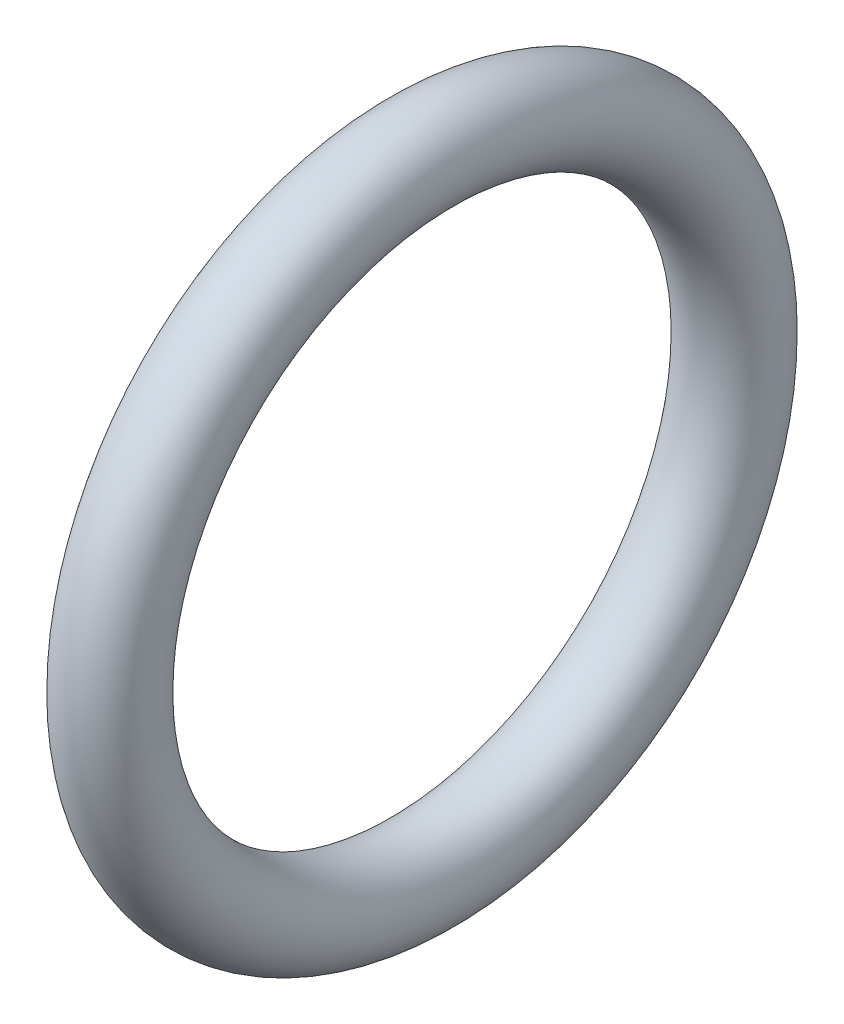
ISO-10303-21;
HEADER;
FILE_DESCRIPTION(('STEP AP214'),'2;1');
FILE_NAME('part.step','',(''),(''),'','','');
FILE_SCHEMA(('AUTOMOTIVE_DESIGN { 1 0 10303 214 1 1 1 1 }'));
ENDSEC;
DATA;
#1=APPLICATION_CONTEXT('core data for automotive mechanical design processes');
#2=APPLICATION_PROTOCOL_DEFINITION('international standard','automotive_design',2000,#1);
#3=PRODUCT_CONTEXT('',#1,'mechanical');
#4=PRODUCT('Part','Part','',(#3));
#5=PRODUCT_RELATED_PRODUCT_CATEGORY('part','',(#4));
#6=PRODUCT_DEFINITION_FORMATION('','',#4);
#7=PRODUCT_DEFINITION_CONTEXT('part definition',#1,'design');
#8=PRODUCT_DEFINITION('design','',#6,#7);
#9=PRODUCT_DEFINITION_SHAPE('','',#8);
#10=(LENGTH_UNIT() NAMED_UNIT(*) SI_UNIT(.MILLI.,.METRE.));
#11=(NAMED_UNIT(*) PLANE_ANGLE_UNIT() SI_UNIT($,.RADIAN.));
#12=(NAMED_UNIT(*) SI_UNIT($,.STERADIAN.) SOLID_ANGLE_UNIT());
#13=UNCERTAINTY_MEASURE_WITH_UNIT(LENGTH_MEASURE(1.E-05),#10,'distance_accuracy_value','');
#14=(GEOMETRIC_REPRESENTATION_CONTEXT(3) GLOBAL_UNCERTAINTY_ASSIGNED_CONTEXT((#13)) GLOBAL_UNIT_ASSIGNED_CONTEXT((#10,
#11,#12)) REPRESENTATION_CONTEXT('',''));
#15=CARTESIAN_POINT('',(0.,0.,0.));
#16=DIRECTION('',(0.,0.,1.));
#17=DIRECTION('',(1.,0.,0.));
#18=AXIS2_PLACEMENT_3D('',#15,#16,#17);
#19=CARTESIAN_POINT('',(0.5,0.,0.));
#20=DIRECTION('',(-1.,0.,0.));
#21=DIRECTION('',(0.,0.,1.));
#22=AXIS2_PLACEMENT_3D('',#19,#20,#21);
#23=TOROIDAL_SURFACE('',#22,3.5,0.5);
#24=CARTESIAN_POINT('',(0.5,0.,4.));
#25=VERTEX_POINT('',#24);
#26=VERTEX_LOOP('',#25);
#27=FACE_BOUND('',#26,.T.);
#28=ADVANCED_FACE('F20',(#27),#23,.T.);
#29=CLOSED_SHELL('',(#28));
#30=MANIFOLD_SOLID_BREP('B2',#29);
#31=ADVANCED_BREP_SHAPE_REPRESENTATION('',(#18,#30),#14);
#32=SHAPE_DEFINITION_REPRESENTATION(#9,#31);
ENDSEC;
END-ISO-10303-21;
